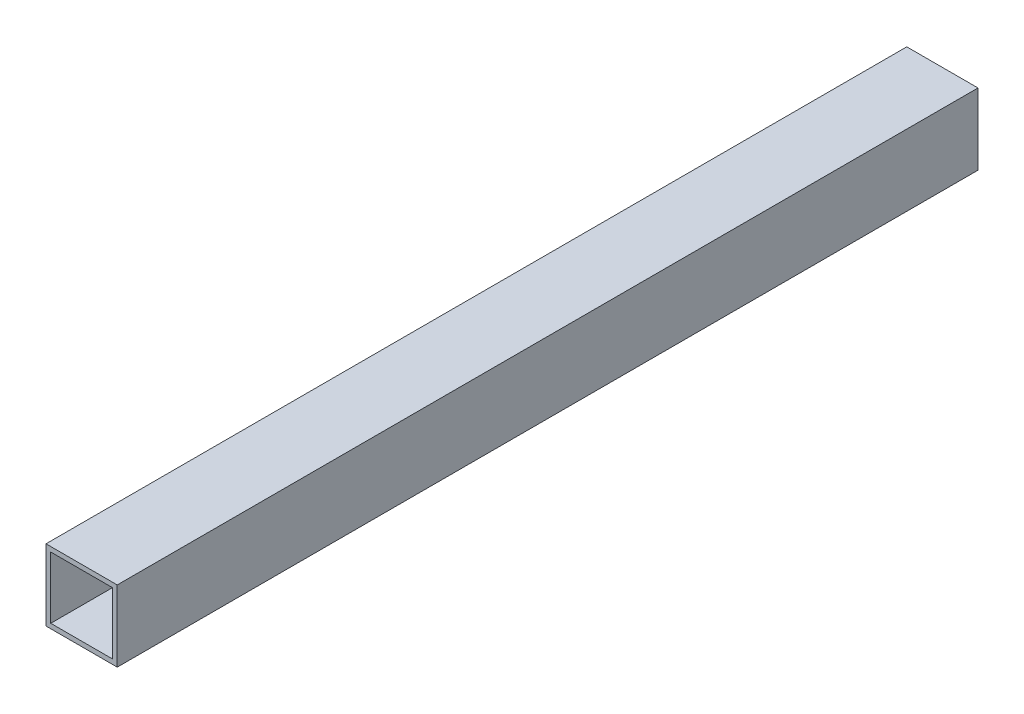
ISO-10303-21;
HEADER;
FILE_DESCRIPTION(('STEP AP214'),'2;1');
FILE_NAME('part.step','',(''),(''),'','','');
FILE_SCHEMA(('AUTOMOTIVE_DESIGN { 1 0 10303 214 1 1 1 1 }'));
ENDSEC;
DATA;
#1=APPLICATION_CONTEXT('core data for automotive mechanical design processes');
#2=APPLICATION_PROTOCOL_DEFINITION('international standard','automotive_design',2000,#1);
#3=PRODUCT_CONTEXT('',#1,'mechanical');
#4=PRODUCT('Part','Part','',(#3));
#5=PRODUCT_RELATED_PRODUCT_CATEGORY('part','',(#4));
#6=PRODUCT_DEFINITION_FORMATION('','',#4);
#7=PRODUCT_DEFINITION_CONTEXT('part definition',#1,'design');
#8=PRODUCT_DEFINITION('design','',#6,#7);
#9=PRODUCT_DEFINITION_SHAPE('','',#8);
#10=(LENGTH_UNIT() NAMED_UNIT(*) SI_UNIT(.MILLI.,.METRE.));
#11=(NAMED_UNIT(*) PLANE_ANGLE_UNIT() SI_UNIT($,.RADIAN.));
#12=(NAMED_UNIT(*) SI_UNIT($,.STERADIAN.) SOLID_ANGLE_UNIT());
#13=UNCERTAINTY_MEASURE_WITH_UNIT(LENGTH_MEASURE(1.E-05),#10,'distance_accuracy_value','');
#14=(GEOMETRIC_REPRESENTATION_CONTEXT(3) GLOBAL_UNCERTAINTY_ASSIGNED_CONTEXT((#13)) GLOBAL_UNIT_ASSIGNED_CONTEXT((#10,
#11,#12)) REPRESENTATION_CONTEXT('',''));
#15=CARTESIAN_POINT('',(0.,0.,0.));
#16=DIRECTION('',(0.,0.,1.));
#17=DIRECTION('',(1.,0.,0.));
#18=AXIS2_PLACEMENT_3D('',#15,#16,#17);
#19=CARTESIAN_POINT('',(0.,0.,725.));
#20=DIRECTION('',(0.,0.,1.));
#21=DIRECTION('',(1.,0.,0.));
#22=AXIS2_PLACEMENT_3D('',#19,#20,#21);
#23=PLANE('',#22);
#24=DIRECTION('',(0.,-1.,0.));
#25=VECTOR('',#24,1.);
#26=CARTESIAN_POINT('',(-26.,26.,725.));
#27=LINE('',#26,#25);
#28=CARTESIAN_POINT('',(-26.,26.,725.));
#29=VERTEX_POINT('',#28);
#30=CARTESIAN_POINT('',(-26.,-26.,725.));
#31=VERTEX_POINT('',#30);
#32=EDGE_CURVE('E24',#29,#31,#27,.T.);
#33=ORIENTED_EDGE('',*,*,#32,.F.);
#34=DIRECTION('',(-1.,0.,0.));
#35=VECTOR('',#34,1.);
#36=CARTESIAN_POINT('',(26.,26.,725.));
#37=LINE('',#36,#35);
#38=CARTESIAN_POINT('',(26.,26.,725.));
#39=VERTEX_POINT('',#38);
#40=EDGE_CURVE('E112',#39,#29,#37,.T.);
#41=ORIENTED_EDGE('',*,*,#40,.F.);
#42=DIRECTION('',(0.,1.,0.));
#43=VECTOR('',#42,1.);
#44=CARTESIAN_POINT('',(26.,-26.,725.));
#45=LINE('',#44,#43);
#46=CARTESIAN_POINT('',(26.,-26.,725.));
#47=VERTEX_POINT('',#46);
#48=EDGE_CURVE('E121',#47,#39,#45,.T.);
#49=ORIENTED_EDGE('',*,*,#48,.F.);
#50=DIRECTION('',(1.,0.,0.));
#51=VECTOR('',#50,1.);
#52=CARTESIAN_POINT('',(-26.,-26.,725.));
#53=LINE('',#52,#51);
#54=EDGE_CURVE('E124',#31,#47,#53,.T.);
#55=ORIENTED_EDGE('',*,*,#54,.F.);
#56=EDGE_LOOP('',(#33,#41,#49,#55));
#57=FACE_BOUND('',#56,.T.);
#58=DIRECTION('',(1.,0.,0.));
#59=VECTOR('',#58,1.);
#60=CARTESIAN_POINT('',(-30.,-30.,725.));
#61=LINE('',#60,#59);
#62=CARTESIAN_POINT('',(-30.,-30.,725.));
#63=VERTEX_POINT('',#62);
#64=CARTESIAN_POINT('',(30.,-30.,725.));
#65=VERTEX_POINT('',#64);
#66=EDGE_CURVE('E179',#63,#65,#61,.T.);
#67=ORIENTED_EDGE('',*,*,#66,.T.);
#68=DIRECTION('',(0.,1.,0.));
#69=VECTOR('',#68,1.);
#70=CARTESIAN_POINT('',(30.,-30.,725.));
#71=LINE('',#70,#69);
#72=CARTESIAN_POINT('',(30.,30.,725.));
#73=VERTEX_POINT('',#72);
#74=EDGE_CURVE('E169',#65,#73,#71,.T.);
#75=ORIENTED_EDGE('',*,*,#74,.T.);
#76=DIRECTION('',(-1.,0.,0.));
#77=VECTOR('',#76,1.);
#78=CARTESIAN_POINT('',(30.,30.,725.));
#79=LINE('',#78,#77);
#80=CARTESIAN_POINT('',(-30.,30.,725.));
#81=VERTEX_POINT('',#80);
#82=EDGE_CURVE('E157',#73,#81,#79,.T.);
#83=ORIENTED_EDGE('',*,*,#82,.T.);
#84=DIRECTION('',(0.,-1.,0.));
#85=VECTOR('',#84,1.);
#86=CARTESIAN_POINT('',(-30.,30.,725.));
#87=LINE('',#86,#85);
#88=EDGE_CURVE('E151',#81,#63,#87,.T.);
#89=ORIENTED_EDGE('',*,*,#88,.T.);
#90=EDGE_LOOP('',(#67,#75,#83,#89));
#91=FACE_BOUND('',#90,.T.);
#92=ADVANCED_FACE('F16',(#57,#91),#23,.T.);
#93=CARTESIAN_POINT('',(0.,0.,0.));
#94=DIRECTION('',(0.,0.,1.));
#95=DIRECTION('',(1.,0.,0.));
#96=AXIS2_PLACEMENT_3D('',#93,#94,#95);
#97=PLANE('',#96);
#98=DIRECTION('',(1.,0.,0.));
#99=VECTOR('',#98,1.);
#100=CARTESIAN_POINT('',(-26.,-26.,0.));
#101=LINE('',#100,#99);
#102=CARTESIAN_POINT('',(-26.,-26.,0.));
#103=VERTEX_POINT('',#102);
#104=CARTESIAN_POINT('',(26.,-26.,0.));
#105=VERTEX_POINT('',#104);
#106=EDGE_CURVE('E115',#103,#105,#101,.T.);
#107=ORIENTED_EDGE('',*,*,#106,.T.);
#108=DIRECTION('',(0.,1.,0.));
#109=VECTOR('',#108,1.);
#110=CARTESIAN_POINT('',(26.,-26.,0.));
#111=LINE('',#110,#109);
#112=CARTESIAN_POINT('',(26.,26.,0.));
#113=VERTEX_POINT('',#112);
#114=EDGE_CURVE('E101',#105,#113,#111,.T.);
#115=ORIENTED_EDGE('',*,*,#114,.T.);
#116=DIRECTION('',(-1.,0.,0.));
#117=VECTOR('',#116,1.);
#118=CARTESIAN_POINT('',(26.,26.,0.));
#119=LINE('',#118,#117);
#120=CARTESIAN_POINT('',(-26.,26.,0.));
#121=VERTEX_POINT('',#120);
#122=EDGE_CURVE('E142',#113,#121,#119,.T.);
#123=ORIENTED_EDGE('',*,*,#122,.T.);
#124=DIRECTION('',(0.,-1.,0.));
#125=VECTOR('',#124,1.);
#126=CARTESIAN_POINT('',(-26.,26.,0.));
#127=LINE('',#126,#125);
#128=EDGE_CURVE('E10',#121,#103,#127,.T.);
#129=ORIENTED_EDGE('',*,*,#128,.T.);
#130=EDGE_LOOP('',(#107,#115,#123,#129));
#131=FACE_BOUND('',#130,.T.);
#132=DIRECTION('',(0.,-1.,0.));
#133=VECTOR('',#132,1.);
#134=CARTESIAN_POINT('',(-30.,30.,0.));
#135=LINE('',#134,#133);
#136=CARTESIAN_POINT('',(-30.,30.,0.));
#137=VERTEX_POINT('',#136);
#138=CARTESIAN_POINT('',(-30.,-30.,0.));
#139=VERTEX_POINT('',#138);
#140=EDGE_CURVE('E154',#137,#139,#135,.T.);
#141=ORIENTED_EDGE('',*,*,#140,.F.);
#142=DIRECTION('',(-1.,0.,0.));
#143=VECTOR('',#142,1.);
#144=CARTESIAN_POINT('',(30.,30.,0.));
#145=LINE('',#144,#143);
#146=CARTESIAN_POINT('',(30.,30.,0.));
#147=VERTEX_POINT('',#146);
#148=EDGE_CURVE('E165',#147,#137,#145,.T.);
#149=ORIENTED_EDGE('',*,*,#148,.F.);
#150=DIRECTION('',(0.,1.,0.));
#151=VECTOR('',#150,1.);
#152=CARTESIAN_POINT('',(30.,-30.,0.));
#153=LINE('',#152,#151);
#154=CARTESIAN_POINT('',(30.,-30.,0.));
#155=VERTEX_POINT('',#154);
#156=EDGE_CURVE('E170',#155,#147,#153,.T.);
#157=ORIENTED_EDGE('',*,*,#156,.F.);
#158=DIRECTION('',(1.,0.,0.));
#159=VECTOR('',#158,1.);
#160=CARTESIAN_POINT('',(-30.,-30.,0.));
#161=LINE('',#160,#159);
#162=EDGE_CURVE('E190',#139,#155,#161,.T.);
#163=ORIENTED_EDGE('',*,*,#162,.F.);
#164=EDGE_LOOP('',(#141,#149,#157,#163));
#165=FACE_BOUND('',#164,.T.);
#166=ADVANCED_FACE('F116',(#131,#165),#97,.F.);
#167=CARTESIAN_POINT('',(-26.,26.,0.));
#168=DIRECTION('',(1.,0.,0.));
#169=DIRECTION('',(0.,1.,0.));
#170=AXIS2_PLACEMENT_3D('',#167,#168,#169);
#171=PLANE('',#170);
#172=DIRECTION('',(0.,0.,1.));
#173=VECTOR('',#172,1.);
#174=CARTESIAN_POINT('',(-26.,26.,0.));
#175=LINE('',#174,#173);
#176=EDGE_CURVE('E140',#121,#29,#175,.T.);
#177=ORIENTED_EDGE('',*,*,#176,.T.);
#178=ORIENTED_EDGE('',*,*,#32,.T.);
#179=DIRECTION('',(0.,0.,1.));
#180=VECTOR('',#179,1.);
#181=CARTESIAN_POINT('',(-26.,-26.,0.));
#182=LINE('',#181,#180);
#183=EDGE_CURVE('E130',#103,#31,#182,.T.);
#184=ORIENTED_EDGE('',*,*,#183,.F.);
#185=ORIENTED_EDGE('',*,*,#128,.F.);
#186=EDGE_LOOP('',(#177,#178,#184,#185));
#187=FACE_BOUND('',#186,.T.);
#188=ADVANCED_FACE('F226',(#187),#171,.T.);
#189=CARTESIAN_POINT('',(26.,26.,0.));
#190=DIRECTION('',(0.,-1.,0.));
#191=DIRECTION('',(0.,0.,-1.));
#192=AXIS2_PLACEMENT_3D('',#189,#190,#191);
#193=PLANE('',#192);
#194=DIRECTION('',(0.,0.,1.));
#195=VECTOR('',#194,1.);
#196=CARTESIAN_POINT('',(26.,26.,0.));
#197=LINE('',#196,#195);
#198=EDGE_CURVE('E109',#113,#39,#197,.T.);
#199=ORIENTED_EDGE('',*,*,#198,.T.);
#200=ORIENTED_EDGE('',*,*,#40,.T.);
#201=ORIENTED_EDGE('',*,*,#176,.F.);
#202=ORIENTED_EDGE('',*,*,#122,.F.);
#203=EDGE_LOOP('',(#199,#200,#201,#202));
#204=FACE_BOUND('',#203,.T.);
#205=ADVANCED_FACE('F230',(#204),#193,.T.);
#206=CARTESIAN_POINT('',(26.,-26.,0.));
#207=DIRECTION('',(-1.,0.,0.));
#208=DIRECTION('',(0.,0.,1.));
#209=AXIS2_PLACEMENT_3D('',#206,#207,#208);
#210=PLANE('',#209);
#211=DIRECTION('',(0.,0.,1.));
#212=VECTOR('',#211,1.);
#213=CARTESIAN_POINT('',(26.,-26.,0.));
#214=LINE('',#213,#212);
#215=EDGE_CURVE('E106',#105,#47,#214,.T.);
#216=ORIENTED_EDGE('',*,*,#215,.T.);
#217=ORIENTED_EDGE('',*,*,#48,.T.);
#218=ORIENTED_EDGE('',*,*,#198,.F.);
#219=ORIENTED_EDGE('',*,*,#114,.F.);
#220=EDGE_LOOP('',(#216,#217,#218,#219));
#221=FACE_BOUND('',#220,.T.);
#222=ADVANCED_FACE('F103',(#221),#210,.T.);
#223=CARTESIAN_POINT('',(-26.,-26.,0.));
#224=DIRECTION('',(0.,1.,0.));
#225=DIRECTION('',(1.,0.,0.));
#226=AXIS2_PLACEMENT_3D('',#223,#224,#225);
#227=PLANE('',#226);
#228=ORIENTED_EDGE('',*,*,#183,.T.);
#229=ORIENTED_EDGE('',*,*,#54,.T.);
#230=ORIENTED_EDGE('',*,*,#215,.F.);
#231=ORIENTED_EDGE('',*,*,#106,.F.);
#232=EDGE_LOOP('',(#228,#229,#230,#231));
#233=FACE_BOUND('',#232,.T.);
#234=ADVANCED_FACE('F123',(#233),#227,.T.);
#235=CARTESIAN_POINT('',(-30.,30.,0.));
#236=DIRECTION('',(1.,0.,0.));
#237=DIRECTION('',(0.,1.,0.));
#238=AXIS2_PLACEMENT_3D('',#235,#236,#237);
#239=PLANE('',#238);
#240=ORIENTED_EDGE('',*,*,#140,.T.);
#241=DIRECTION('',(0.,0.,1.));
#242=VECTOR('',#241,1.);
#243=CARTESIAN_POINT('',(-30.,-30.,0.));
#244=LINE('',#243,#242);
#245=EDGE_CURVE('E175',#139,#63,#244,.T.);
#246=ORIENTED_EDGE('',*,*,#245,.T.);
#247=ORIENTED_EDGE('',*,*,#88,.F.);
#248=DIRECTION('',(0.,0.,1.));
#249=VECTOR('',#248,1.);
#250=CARTESIAN_POINT('',(-30.,30.,0.));
#251=LINE('',#250,#249);
#252=EDGE_CURVE('E160',#137,#81,#251,.T.);
#253=ORIENTED_EDGE('',*,*,#252,.F.);
#254=EDGE_LOOP('',(#240,#246,#247,#253));
#255=FACE_BOUND('',#254,.T.);
#256=ADVANCED_FACE('F209',(#255),#239,.F.);
#257=CARTESIAN_POINT('',(30.,30.,0.));
#258=DIRECTION('',(0.,-1.,0.));
#259=DIRECTION('',(0.,0.,-1.));
#260=AXIS2_PLACEMENT_3D('',#257,#258,#259);
#261=PLANE('',#260);
#262=ORIENTED_EDGE('',*,*,#148,.T.);
#263=ORIENTED_EDGE('',*,*,#252,.T.);
#264=ORIENTED_EDGE('',*,*,#82,.F.);
#265=DIRECTION('',(0.,0.,1.));
#266=VECTOR('',#265,1.);
#267=CARTESIAN_POINT('',(30.,30.,0.));
#268=LINE('',#267,#266);
#269=EDGE_CURVE('E174',#147,#73,#268,.T.);
#270=ORIENTED_EDGE('',*,*,#269,.F.);
#271=EDGE_LOOP('',(#262,#263,#264,#270));
#272=FACE_BOUND('',#271,.T.);
#273=ADVANCED_FACE('F211',(#272),#261,.F.);
#274=CARTESIAN_POINT('',(30.,-30.,0.));
#275=DIRECTION('',(-1.,0.,0.));
#276=DIRECTION('',(0.,0.,1.));
#277=AXIS2_PLACEMENT_3D('',#274,#275,#276);
#278=PLANE('',#277);
#279=ORIENTED_EDGE('',*,*,#156,.T.);
#280=ORIENTED_EDGE('',*,*,#269,.T.);
#281=ORIENTED_EDGE('',*,*,#74,.F.);
#282=DIRECTION('',(0.,0.,1.));
#283=VECTOR('',#282,1.);
#284=CARTESIAN_POINT('',(30.,-30.,0.));
#285=LINE('',#284,#283);
#286=EDGE_CURVE('E186',#155,#65,#285,.T.);
#287=ORIENTED_EDGE('',*,*,#286,.F.);
#288=EDGE_LOOP('',(#279,#280,#281,#287));
#289=FACE_BOUND('',#288,.T.);
#290=ADVANCED_FACE('F204',(#289),#278,.F.);
#291=CARTESIAN_POINT('',(-30.,-30.,0.));
#292=DIRECTION('',(0.,1.,0.));
#293=DIRECTION('',(1.,0.,0.));
#294=AXIS2_PLACEMENT_3D('',#291,#292,#293);
#295=PLANE('',#294);
#296=ORIENTED_EDGE('',*,*,#162,.T.);
#297=ORIENTED_EDGE('',*,*,#286,.T.);
#298=ORIENTED_EDGE('',*,*,#66,.F.);
#299=ORIENTED_EDGE('',*,*,#245,.F.);
#300=EDGE_LOOP('',(#296,#297,#298,#299));
#301=FACE_BOUND('',#300,.T.);
#302=ADVANCED_FACE('F200',(#301),#295,.F.);
#303=CLOSED_SHELL('',(#92,#166,#188,#205,#222,#234,#256,#273,#290,#302));
#304=MANIFOLD_SOLID_BREP('B1',#303);
#305=ADVANCED_BREP_SHAPE_REPRESENTATION('',(#18,#304),#14);
#306=SHAPE_DEFINITION_REPRESENTATION(#9,#305);
ENDSEC;
END-ISO-10303-21;
